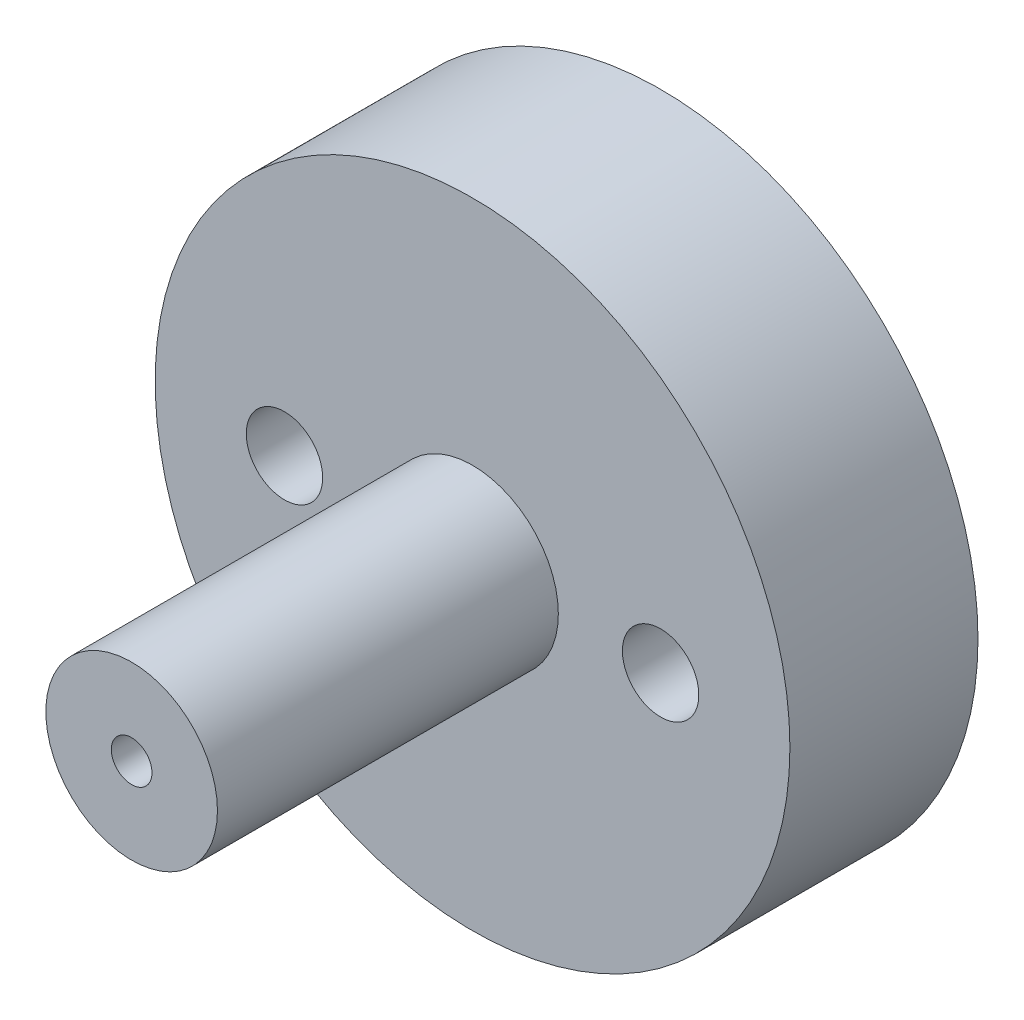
ISO-10303-21;
HEADER;
FILE_DESCRIPTION(('STEP AP214'),'2;1');
FILE_NAME('part.step','',(''),(''),'','','');
FILE_SCHEMA(('AUTOMOTIVE_DESIGN { 1 0 10303 214 1 1 1 1 }'));
ENDSEC;
DATA;
#1=APPLICATION_CONTEXT('core data for automotive mechanical design processes');
#2=APPLICATION_PROTOCOL_DEFINITION('international standard','automotive_design',2000,#1);
#3=PRODUCT_CONTEXT('',#1,'mechanical');
#4=PRODUCT('Part','Part','',(#3));
#5=PRODUCT_RELATED_PRODUCT_CATEGORY('part','',(#4));
#6=PRODUCT_DEFINITION_FORMATION('','',#4);
#7=PRODUCT_DEFINITION_CONTEXT('part definition',#1,'design');
#8=PRODUCT_DEFINITION('design','',#6,#7);
#9=PRODUCT_DEFINITION_SHAPE('','',#8);
#10=(LENGTH_UNIT() NAMED_UNIT(*) SI_UNIT(.MILLI.,.METRE.));
#11=(NAMED_UNIT(*) PLANE_ANGLE_UNIT() SI_UNIT($,.RADIAN.));
#12=(NAMED_UNIT(*) SI_UNIT($,.STERADIAN.) SOLID_ANGLE_UNIT());
#13=UNCERTAINTY_MEASURE_WITH_UNIT(LENGTH_MEASURE(1.E-05),#10,'distance_accuracy_value','');
#14=(GEOMETRIC_REPRESENTATION_CONTEXT(3) GLOBAL_UNCERTAINTY_ASSIGNED_CONTEXT((#13)) GLOBAL_UNIT_ASSIGNED_CONTEXT((#10,
#11,#12)) REPRESENTATION_CONTEXT('',''));
#15=CARTESIAN_POINT('',(0.,0.,0.));
#16=DIRECTION('',(0.,0.,1.));
#17=DIRECTION('',(1.,0.,0.));
#18=AXIS2_PLACEMENT_3D('',#15,#16,#17);
#19=CARTESIAN_POINT('',(0.,0.,12.));
#20=DIRECTION('',(0.,0.,1.));
#21=DIRECTION('',(-1.,0.,0.));
#22=AXIS2_PLACEMENT_3D('',#19,#20,#21);
#23=CYLINDRICAL_SURFACE('',#22,0.865);
#24=CARTESIAN_POINT('',(0.,0.,32.));
#25=DIRECTION('',(0.,0.,-1.));
#26=DIRECTION('',(-1.,0.,0.));
#27=AXIS2_PLACEMENT_3D('',#24,#25,#26);
#28=CIRCLE('',#27,0.865);
#29=CARTESIAN_POINT('',(0.865,0.,32.));
#30=VERTEX_POINT('',#29);
#31=EDGE_CURVE('E368',#30,#30,#28,.T.);
#32=ORIENTED_EDGE('',*,*,#31,.F.);
#33=DIRECTION('',(0.,0.,-1.));
#34=VECTOR('',#33,1.);
#35=CARTESIAN_POINT('',(0.865,0.,12.));
#36=LINE('',#35,#34);
#37=CARTESIAN_POINT('',(0.865,0.,20.));
#38=VERTEX_POINT('',#37);
#39=EDGE_CURVE('E11',#30,#38,#36,.T.);
#40=ORIENTED_EDGE('',*,*,#39,.T.);
#41=CARTESIAN_POINT('',(0.,0.,20.));
#42=DIRECTION('',(0.,0.,-1.));
#43=DIRECTION('',(-1.,0.,0.));
#44=AXIS2_PLACEMENT_3D('',#41,#42,#43);
#45=CIRCLE('',#44,0.865);
#46=EDGE_CURVE('E302',#38,#38,#45,.T.);
#47=ORIENTED_EDGE('',*,*,#46,.T.);
#48=ORIENTED_EDGE('',*,*,#39,.F.);
#49=EDGE_LOOP('',(#32,#40,#47,#48));
#50=FACE_BOUND('',#49,.T.);
#51=ADVANCED_FACE('F51',(#50),#23,.F.);
#52=CARTESIAN_POINT('',(0.,0.,32.));
#53=DIRECTION('',(0.,0.,-1.));
#54=DIRECTION('',(-1.,0.,0.));
#55=AXIS2_PLACEMENT_3D('',#52,#53,#54);
#56=CYLINDRICAL_SURFACE('',#55,3.65);
#57=CARTESIAN_POINT('',(-1.175,-3.45570181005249,19.407216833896));
#58=CARTESIAN_POINT('',(-1.17499976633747,-3.45570186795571,19.3346445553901));
#59=CARTESIAN_POINT('',(-1.17251493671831,-3.45654997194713,19.2620684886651));
#60=CARTESIAN_POINT('',(-1.16203956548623,-3.46008615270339,19.117320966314));
#61=CARTESIAN_POINT('',(-1.15404749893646,-3.46277473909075,19.0451496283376));
#62=CARTESIAN_POINT('',(-1.13190031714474,-3.47007767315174,18.902100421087));
#63=CARTESIAN_POINT('',(-1.117767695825,-3.47468498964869,18.8312188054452));
#64=CARTESIAN_POINT('',(-1.08252275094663,-3.4858266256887,18.6914087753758));
#65=CARTESIAN_POINT('',(-1.0614175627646,-3.49235897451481,18.622478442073));
#66=CARTESIAN_POINT('',(-1.00988058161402,-3.50762150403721,18.4839180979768));
#67=CARTESIAN_POINT('',(-0.978992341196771,-3.51645435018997,18.4144654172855));
#68=CARTESIAN_POINT('',(-0.907344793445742,-3.53561855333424,18.2810589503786));
#69=CARTESIAN_POINT('',(-0.866597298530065,-3.54594811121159,18.2170987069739));
#70=CARTESIAN_POINT('',(-0.781646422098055,-3.56554597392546,18.1064793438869));
#71=CARTESIAN_POINT('',(-0.738932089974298,-3.57473399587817,18.058671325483));
#72=CARTESIAN_POINT('',(-0.646045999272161,-3.59268085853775,17.9707609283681));
#73=CARTESIAN_POINT('',(-0.595875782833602,-3.60143978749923,17.9306569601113));
#74=CARTESIAN_POINT('',(-0.488423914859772,-3.61758329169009,17.8598568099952));
#75=CARTESIAN_POINT('',(-0.431087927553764,-3.62495615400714,17.8292395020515));
#76=CARTESIAN_POINT('',(-0.31130946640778,-3.63719546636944,17.7796946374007));
#77=CARTESIAN_POINT('',(-0.248871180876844,-3.64206394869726,17.7607575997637));
#78=CARTESIAN_POINT('',(-0.130390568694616,-3.6480828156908,17.7375421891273));
#79=CARTESIAN_POINT('',(-0.0746986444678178,-3.64966292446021,17.7315644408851));
#80=CARTESIAN_POINT('',(0.0368802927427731,-3.6502391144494,17.7293729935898));
#81=CARTESIAN_POINT('',(0.0927672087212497,-3.64923633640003,17.7331549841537));
#82=CARTESIAN_POINT('',(0.199577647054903,-3.64490822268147,17.749762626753));
#83=CARTESIAN_POINT('',(0.250596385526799,-3.64172775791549,17.7620246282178));
#84=CARTESIAN_POINT('',(0.349883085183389,-3.63353336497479,17.7944507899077));
#85=CARTESIAN_POINT('',(0.398151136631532,-3.62851949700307,17.8146146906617));
#86=CARTESIAN_POINT('',(0.492467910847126,-3.61694808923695,17.8628515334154));
#87=CARTESIAN_POINT('',(0.538383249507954,-3.61034339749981,17.8911725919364));
#88=CARTESIAN_POINT('',(0.625352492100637,-3.59630069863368,17.9542955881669));
#89=CARTESIAN_POINT('',(0.666404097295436,-3.5888623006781,17.9891005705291));
#90=CARTESIAN_POINT('',(0.75739518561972,-3.57095670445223,18.0778320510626));
#91=CARTESIAN_POINT('',(0.805051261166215,-3.56038164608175,18.1340834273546));
#92=CARTESIAN_POINT('',(0.890512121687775,-3.53997502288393,18.2537388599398));
#93=CARTESIAN_POINT('',(0.928298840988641,-3.53014484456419,18.3171557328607));
#94=CARTESIAN_POINT('',(1.00769995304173,-3.50847066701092,18.474583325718));
#95=CARTESIAN_POINT('',(1.04501554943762,-3.49734620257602,18.5708472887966));
#96=CARTESIAN_POINT('',(1.104555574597,-3.47899552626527,18.7682369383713));
#97=CARTESIAN_POINT('',(1.12675313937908,-3.47177625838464,18.8693709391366));
#98=CARTESIAN_POINT('',(1.15478942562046,-3.46252903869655,19.0495565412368));
#99=CARTESIAN_POINT('',(1.16325280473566,-3.45967793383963,19.1281855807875));
#100=CARTESIAN_POINT('',(1.17371038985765,-3.45614472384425,19.2859526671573));
#101=CARTESIAN_POINT('',(1.17570097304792,-3.45546383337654,19.3650909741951));
#102=CARTESIAN_POINT('',(1.17386769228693,-3.45608643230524,19.5234927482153));
#103=CARTESIAN_POINT('',(1.17002778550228,-3.45739539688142,19.6027559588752));
#104=CARTESIAN_POINT('',(1.15695723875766,-3.46179102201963,19.7607613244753));
#105=CARTESIAN_POINT('',(1.14772775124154,-3.4648773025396,19.8395035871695));
#106=CARTESIAN_POINT('',(1.12353614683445,-3.47279959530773,20.0000554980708));
#107=CARTESIAN_POINT('',(1.1083102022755,-3.47771545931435,20.081821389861));
#108=CARTESIAN_POINT('',(1.07223135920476,-3.48900819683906,20.2440339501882));
#109=CARTESIAN_POINT('',(1.05137640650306,-3.49538560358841,20.324480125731));
#110=CARTESIAN_POINT('',(1.00392323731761,-3.5093087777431,20.4832095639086));
#111=CARTESIAN_POINT('',(0.977348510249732,-3.51684973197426,20.5615002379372));
#112=CARTESIAN_POINT('',(0.917907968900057,-3.53283131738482,20.7155208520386));
#113=CARTESIAN_POINT('',(0.885047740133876,-3.54127114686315,20.7912529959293));
#114=CARTESIAN_POINT('',(0.821238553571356,-3.55652270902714,20.9205616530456));
#115=CARTESIAN_POINT('',(0.791875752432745,-3.56321215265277,20.9749327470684));
#116=CARTESIAN_POINT('',(0.728437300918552,-3.57672119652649,21.08095549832));
#117=CARTESIAN_POINT('',(0.694356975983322,-3.58354092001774,21.1326043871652));
#118=CARTESIAN_POINT('',(0.620393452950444,-3.59708798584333,21.2323047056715));
#119=CARTESIAN_POINT('',(0.580465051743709,-3.60381411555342,21.2803232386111));
#120=CARTESIAN_POINT('',(0.493983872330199,-3.61668167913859,21.3701117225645));
#121=CARTESIAN_POINT('',(0.44744790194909,-3.62282453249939,21.4118969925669));
#122=CARTESIAN_POINT('',(0.366818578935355,-3.63164850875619,21.4709590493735));
#123=CARTESIAN_POINT('',(0.335096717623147,-3.63473711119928,21.4913881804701));
#124=CARTESIAN_POINT('',(0.268946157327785,-3.64022901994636,21.5274439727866));
#125=CARTESIAN_POINT('',(0.234519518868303,-3.64263284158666,21.543074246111));
#126=CARTESIAN_POINT('',(0.162964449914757,-3.64653765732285,21.568351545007));
#127=CARTESIAN_POINT('',(0.125808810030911,-3.64802760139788,21.5779253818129));
#128=CARTESIAN_POINT('',(0.0503198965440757,-3.64984734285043,21.5896072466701));
#129=CARTESIAN_POINT('',(0.0119882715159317,-3.65017869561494,21.5917252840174));
#130=CARTESIAN_POINT('',(-0.0591979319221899,-3.64967030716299,21.5884669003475));
#131=CARTESIAN_POINT('',(-0.092102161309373,-3.64898063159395,21.5840508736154));
#132=CARTESIAN_POINT('',(-0.156709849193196,-3.64677790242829,21.5698829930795));
#133=CARTESIAN_POINT('',(-0.188412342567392,-3.64526420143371,21.5601269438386));
#134=CARTESIAN_POINT('',(-0.260019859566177,-3.64095637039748,21.5321776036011));
#135=CARTESIAN_POINT('',(-0.299234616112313,-3.63790580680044,21.5122714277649));
#136=CARTESIAN_POINT('',(-0.373965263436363,-3.63098695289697,21.4665624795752));
#137=CARTESIAN_POINT('',(-0.409472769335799,-3.62711686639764,21.4407467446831));
#138=CARTESIAN_POINT('',(-0.498301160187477,-3.61625407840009,21.3671764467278));
#139=CARTESIAN_POINT('',(-0.548621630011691,-3.60883866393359,21.315898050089));
#140=CARTESIAN_POINT('',(-0.641236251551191,-3.5935385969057,21.206644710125));
#141=CARTESIAN_POINT('',(-0.683506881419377,-3.58565265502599,21.148650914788));
#142=CARTESIAN_POINT('',(-0.759305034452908,-3.57034477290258,21.0316153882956));
#143=CARTESIAN_POINT('',(-0.793178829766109,-3.56292053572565,20.972794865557));
#144=CARTESIAN_POINT('',(-0.855858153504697,-3.54838574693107,20.8524447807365));
#145=CARTESIAN_POINT('',(-0.884659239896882,-3.54127547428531,20.7909129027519));
#146=CARTESIAN_POINT('',(-0.937798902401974,-3.52757494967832,20.6658317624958));
#147=CARTESIAN_POINT('',(-0.96213262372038,-3.52098526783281,20.6022803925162));
#148=CARTESIAN_POINT('',(-1.00669557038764,-3.50850372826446,20.4736841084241));
#149=CARTESIAN_POINT('',(-1.0269240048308,-3.50261200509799,20.408638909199));
#150=CARTESIAN_POINT('',(-1.06636321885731,-3.49082475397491,20.26713349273));
#151=CARTESIAN_POINT('',(-1.08492016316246,-3.48507271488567,20.1904788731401));
#152=CARTESIAN_POINT('',(-1.11698145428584,-3.47492938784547,20.0360178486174));
#153=CARTESIAN_POINT('',(-1.13048474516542,-3.47053838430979,19.9582112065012));
#154=CARTESIAN_POINT('',(-1.15236107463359,-3.46333607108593,19.8017556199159));
#155=CARTESIAN_POINT('',(-1.16073103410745,-3.4605257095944,19.723106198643));
#156=CARTESIAN_POINT('',(-1.17205011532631,-3.45670871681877,19.5653782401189));
#157=CARTESIAN_POINT('',(-1.17500025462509,-3.45570174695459,19.486299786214));
#158=CARTESIAN_POINT('',(-1.175,-3.45570181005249,19.407216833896));
#159=B_SPLINE_CURVE_WITH_KNOTS('',3,(#57,#58,#59,#60,#61,#62,#63,#64,#65,#66,#67,#68,#69,#70,
#71,#72,#73,#74,#75,#76,#77,#78,#79,#80,#81,#82,#83,#84,#85,#86,#87,#88,#89,#90,#91,#92,#93,#94,
#95,#96,#97,#98,#99,#100,#101,#102,#103,#104,#105,#106,#107,#108,#109,#110,#111,#112,#113,#114,
#115,#116,#117,#118,#119,#120,#121,#122,#123,#124,#125,#126,#127,#128,#129,#130,#131,#132,#133,
#134,#135,#136,#137,#138,#139,#140,#141,#142,#143,#144,#145,#146,#147,#148,#149,#150,#151,#152,
#153,#154,#155,#156,#157,#158),.UNSPECIFIED.,.T.,.F.,(4,2,2,2,2,2,2,2,2,2,2,2,2,2,2,2,2,2,2,2,2,
2,2,2,2,2,2,2,2,2,2,2,2,2,2,2,2,2,2,2,2,2,2,2,2,2,2,2,2,2,4),(0.,0.217664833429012,
0.435389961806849,0.652324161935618,0.86903704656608,1.09789654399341,1.32648318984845,
1.5200037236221,1.71348428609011,1.90853280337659,2.10342278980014,2.27064488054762,
2.43779313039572,2.59478201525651,2.75176574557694,2.91414746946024,3.07660563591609,
3.29880857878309,3.52141545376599,3.83122194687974,4.14157752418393,4.37867408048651,
4.61590331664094,4.8537864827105,5.09161880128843,5.34135608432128,5.5911846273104,
5.84000613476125,6.08860754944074,6.2748840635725,6.46134649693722,6.64933476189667,
6.83685312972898,6.9501051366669,7.0632716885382,7.17778091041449,7.29213634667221,
7.39126440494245,7.49047045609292,7.62197847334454,7.75377776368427,7.96924252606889,
8.18532753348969,8.38987730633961,8.5946053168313,8.79955451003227,9.00454315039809,
9.24158830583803,9.47868296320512,9.71591969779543,9.95311188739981),.UNSPECIFIED.);
#160=CARTESIAN_POINT('',(1.175,-3.45570181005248,19.407216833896));
#161=VERTEX_POINT('',#160);
#162=EDGE_CURVE('E55',#161,#161,#159,.F.);
#163=ORIENTED_EDGE('',*,*,#162,.T.);
#164=EDGE_LOOP('',(#163));
#165=FACE_BOUND('',#164,.T.);
#166=CARTESIAN_POINT('',(0.,0.,17.5));
#167=DIRECTION('',(0.,0.,1.));
#168=DIRECTION('',(-1.,0.,0.));
#169=AXIS2_PLACEMENT_3D('',#166,#167,#168);
#170=CIRCLE('',#169,3.65);
#171=CARTESIAN_POINT('',(3.65,0.,17.5));
#172=VERTEX_POINT('',#171);
#173=EDGE_CURVE('E343',#172,#172,#170,.T.);
#174=ORIENTED_EDGE('',*,*,#173,.T.);
#175=DIRECTION('',(0.,0.,1.));
#176=VECTOR('',#175,1.);
#177=CARTESIAN_POINT('',(3.65,0.,32.));
#178=LINE('',#177,#176);
#179=CARTESIAN_POINT('',(3.65,0.,32.));
#180=VERTEX_POINT('',#179);
#181=EDGE_CURVE('E66',#172,#180,#178,.T.);
#182=ORIENTED_EDGE('',*,*,#181,.T.);
#183=CARTESIAN_POINT('',(0.,0.,32.));
#184=DIRECTION('',(0.,0.,-1.));
#185=DIRECTION('',(-1.,0.,0.));
#186=AXIS2_PLACEMENT_3D('',#183,#184,#185);
#187=CIRCLE('',#186,3.65);
#188=EDGE_CURVE('E346',#180,#180,#187,.T.);
#189=ORIENTED_EDGE('',*,*,#188,.T.);
#190=ORIENTED_EDGE('',*,*,#181,.F.);
#191=EDGE_LOOP('',(#174,#182,#189,#190));
#192=FACE_BOUND('',#191,.T.);
#193=ADVANCED_FACE('F443',(#165,#192),#56,.T.);
#194=CARTESIAN_POINT('',(0.,0.,32.));
#195=DIRECTION('',(0.,0.,1.));
#196=DIRECTION('',(1.,0.,0.));
#197=AXIS2_PLACEMENT_3D('',#194,#195,#196);
#198=PLANE('',#197);
#199=ORIENTED_EDGE('',*,*,#31,.T.);
#200=EDGE_LOOP('',(#199));
#201=FACE_BOUND('',#200,.T.);
#202=ORIENTED_EDGE('',*,*,#188,.F.);
#203=EDGE_LOOP('',(#202));
#204=FACE_BOUND('',#203,.T.);
#205=ADVANCED_FACE('F53',(#201,#204),#198,.T.);
#206=CARTESIAN_POINT('',(-0.69180806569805,-1.19445578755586,17.5));
#207=DIRECTION('',(0.,0.,1.));
#208=DIRECTION('',(1.,0.,0.));
#209=AXIS2_PLACEMENT_3D('',#206,#207,#208);
#210=PLANE('',#209);
#211=ORIENTED_EDGE('',*,*,#173,.F.);
#212=EDGE_LOOP('',(#211));
#213=FACE_BOUND('',#212,.T.);
#214=CARTESIAN_POINT('',(8.,0.,17.5));
#215=DIRECTION('',(0.,0.,-1.));
#216=DIRECTION('',(1.,0.,0.));
#217=AXIS2_PLACEMENT_3D('',#214,#215,#216);
#218=CIRCLE('',#217,1.625);
#219=CARTESIAN_POINT('',(6.375,0.,17.5));
#220=VERTEX_POINT('',#219);
#221=EDGE_CURVE('E329',#220,#220,#218,.T.);
#222=ORIENTED_EDGE('',*,*,#221,.T.);
#223=EDGE_LOOP('',(#222));
#224=FACE_BOUND('',#223,.T.);
#225=CARTESIAN_POINT('',(-8.,0.,17.5));
#226=DIRECTION('',(0.,0.,-1.));
#227=DIRECTION('',(1.,0.,0.));
#228=AXIS2_PLACEMENT_3D('',#225,#226,#227);
#229=CIRCLE('',#228,1.625);
#230=CARTESIAN_POINT('',(-9.625,0.,17.5));
#231=VERTEX_POINT('',#230);
#232=EDGE_CURVE('E316',#231,#231,#229,.T.);
#233=ORIENTED_EDGE('',*,*,#232,.T.);
#234=EDGE_LOOP('',(#233));
#235=FACE_BOUND('',#234,.T.);
#236=CARTESIAN_POINT('',(0.,0.,17.5));
#237=DIRECTION('',(0.,0.,1.));
#238=DIRECTION('',(-1.,0.,0.));
#239=AXIS2_PLACEMENT_3D('',#236,#237,#238);
#240=CIRCLE('',#239,13.5);
#241=CARTESIAN_POINT('',(13.5,0.,17.5));
#242=VERTEX_POINT('',#241);
#243=EDGE_CURVE('E347',#242,#242,#240,.T.);
#244=ORIENTED_EDGE('',*,*,#243,.T.);
#245=EDGE_LOOP('',(#244));
#246=FACE_BOUND('',#245,.T.);
#247=ADVANCED_FACE('F447',(#213,#224,#235,#246),#210,.T.);
#248=CARTESIAN_POINT('',(0.,0.,12.));
#249=DIRECTION('',(0.,0.,-1.));
#250=DIRECTION('',(-1.,0.,0.));
#251=AXIS2_PLACEMENT_3D('',#248,#249,#250);
#252=CYLINDRICAL_SURFACE('',#251,13.5);
#253=CARTESIAN_POINT('',(0.,0.,9.5));
#254=DIRECTION('',(0.,0.,-1.));
#255=DIRECTION('',(1.,0.,0.));
#256=AXIS2_PLACEMENT_3D('',#253,#254,#255);
#257=CIRCLE('',#256,13.5);
#258=CARTESIAN_POINT('',(13.5,0.,9.5));
#259=VERTEX_POINT('',#258);
#260=EDGE_CURVE('E303',#259,#259,#257,.T.);
#261=ORIENTED_EDGE('',*,*,#260,.F.);
#262=DIRECTION('',(0.,0.,1.));
#263=VECTOR('',#262,1.);
#264=CARTESIAN_POINT('',(13.5,0.,12.));
#265=LINE('',#264,#263);
#266=EDGE_CURVE('E360',#259,#242,#265,.T.);
#267=ORIENTED_EDGE('',*,*,#266,.T.);
#268=ORIENTED_EDGE('',*,*,#243,.F.);
#269=ORIENTED_EDGE('',*,*,#266,.F.);
#270=EDGE_LOOP('',(#261,#267,#268,#269));
#271=FACE_BOUND('',#270,.T.);
#272=ADVANCED_FACE('F450',(#271),#252,.T.);
#273=CARTESIAN_POINT('',(0.,0.,15.));
#274=DIRECTION('',(0.,0.,1.));
#275=DIRECTION('',(1.,0.,0.));
#276=AXIS2_PLACEMENT_3D('',#273,#274,#275);
#277=PLANE('',#276);
#278=DIRECTION('',(-1.,0.,0.));
#279=VECTOR('',#278,1.);
#280=CARTESIAN_POINT('',(0.,0.125554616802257,15.));
#281=LINE('',#280,#279);
#282=CARTESIAN_POINT('',(1.1642935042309,0.125554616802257,15.));
#283=VERTEX_POINT('',#282);
#284=CARTESIAN_POINT('',(1.12209752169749,0.125554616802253,15.));
#285=VERTEX_POINT('',#284);
#286=EDGE_CURVE('E176',#283,#285,#281,.T.);
#287=ORIENTED_EDGE('',*,*,#286,.T.);
#288=CARTESIAN_POINT('',(0.,0.,15.));
#289=DIRECTION('',(0.,0.,1.));
#290=DIRECTION('',(1.,0.,0.));
#291=AXIS2_PLACEMENT_3D('',#288,#289,#290);
#292=CIRCLE('',#291,1.1291);
#293=CARTESIAN_POINT('',(-1.12209752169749,0.125554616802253,15.));
#294=VERTEX_POINT('',#293);
#295=EDGE_CURVE('E286',#285,#294,#292,.T.);
#296=ORIENTED_EDGE('',*,*,#295,.T.);
#297=DIRECTION('',(-1.,0.,0.));
#298=VECTOR('',#297,1.);
#299=CARTESIAN_POINT('',(0.,0.125554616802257,15.));
#300=LINE('',#299,#298);
#301=CARTESIAN_POINT('',(-1.1642935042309,0.125554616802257,15.));
#302=VERTEX_POINT('',#301);
#303=EDGE_CURVE('E278',#294,#302,#300,.T.);
#304=ORIENTED_EDGE('',*,*,#303,.T.);
#305=CARTESIAN_POINT('',(0.,-0.0739253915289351,15.));
#306=DIRECTION('',(0.,0.,1.));
#307=DIRECTION('',(0.,1.,0.));
#308=AXIS2_PLACEMENT_3D('',#305,#306,#307);
#309=ELLIPSE('',#308,1.48105508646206,1.175);
#310=CARTESIAN_POINT('',(1.175,-0.0739253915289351,15.));
#311=VERTEX_POINT('',#310);
#312=EDGE_CURVE('E192',#302,#311,#309,.T.);
#313=ORIENTED_EDGE('',*,*,#312,.T.);
#314=CARTESIAN_POINT('',(0.,-0.0739253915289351,15.));
#315=DIRECTION('',(0.,0.,1.));
#316=DIRECTION('',(0.,1.,0.));
#317=AXIS2_PLACEMENT_3D('',#314,#315,#316);
#318=ELLIPSE('',#317,1.48105508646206,1.175);
#319=EDGE_CURVE('E188',#311,#283,#318,.T.);
#320=ORIENTED_EDGE('',*,*,#319,.T.);
#321=EDGE_LOOP('',(#287,#296,#304,#313,#320));
#322=FACE_BOUND('',#321,.T.);
#323=CARTESIAN_POINT('',(0.,0.,15.));
#324=DIRECTION('',(0.,0.,-1.));
#325=DIRECTION('',(1.,0.,0.));
#326=AXIS2_PLACEMENT_3D('',#323,#324,#325);
#327=CIRCLE('',#326,1.725);
#328=CARTESIAN_POINT('',(-1.725,0.,15.));
#329=VERTEX_POINT('',#328);
#330=EDGE_CURVE('E357',#329,#329,#327,.T.);
#331=ORIENTED_EDGE('',*,*,#330,.T.);
#332=EDGE_LOOP('',(#331));
#333=FACE_BOUND('',#332,.T.);
#334=ADVANCED_FACE('F189',(#322,#333),#277,.F.);
#335=CARTESIAN_POINT('',(0.,0.,12.));
#336=DIRECTION('',(0.,0.,1.));
#337=DIRECTION('',(1.,0.,0.));
#338=AXIS2_PLACEMENT_3D('',#335,#336,#337);
#339=CYLINDRICAL_SURFACE('',#338,1.725);
#340=CARTESIAN_POINT('',(0.,0.,12.));
#341=DIRECTION('',(0.,0.,-1.));
#342=DIRECTION('',(1.,0.,0.));
#343=AXIS2_PLACEMENT_3D('',#340,#341,#342);
#344=CIRCLE('',#343,1.725);
#345=CARTESIAN_POINT('',(-1.725,0.,12.));
#346=VERTEX_POINT('',#345);
#347=EDGE_CURVE('E298',#346,#346,#344,.T.);
#348=ORIENTED_EDGE('',*,*,#347,.T.);
#349=DIRECTION('',(0.,0.,1.));
#350=VECTOR('',#349,1.);
#351=CARTESIAN_POINT('',(-1.725,0.,12.));
#352=LINE('',#351,#350);
#353=EDGE_CURVE('E353',#346,#329,#352,.T.);
#354=ORIENTED_EDGE('',*,*,#353,.T.);
#355=ORIENTED_EDGE('',*,*,#330,.F.);
#356=ORIENTED_EDGE('',*,*,#353,.F.);
#357=EDGE_LOOP('',(#348,#354,#355,#356));
#358=FACE_BOUND('',#357,.T.);
#359=ADVANCED_FACE('F490',(#358),#339,.F.);
#360=CARTESIAN_POINT('',(0.,0.,20.));
#361=DIRECTION('',(0.,0.,1.));
#362=DIRECTION('',(1.,0.,0.));
#363=AXIS2_PLACEMENT_3D('',#360,#361,#362);
#364=PLANE('',#363);
#365=ORIENTED_EDGE('',*,*,#46,.F.);
#366=EDGE_LOOP('',(#365));
#367=FACE_BOUND('',#366,.T.);
#368=CARTESIAN_POINT('',(0.,0.,20.));
#369=DIRECTION('',(0.,0.,-1.));
#370=DIRECTION('',(1.,0.,0.));
#371=AXIS2_PLACEMENT_3D('',#368,#369,#370);
#372=CIRCLE('',#371,1.1291);
#373=CARTESIAN_POINT('',(-1.1291,0.,20.));
#374=VERTEX_POINT('',#373);
#375=EDGE_CURVE('E217',#374,#374,#372,.T.);
#376=ORIENTED_EDGE('',*,*,#375,.T.);
#377=EDGE_LOOP('',(#376));
#378=FACE_BOUND('',#377,.T.);
#379=ADVANCED_FACE('F471',(#367,#378),#364,.F.);
#380=CARTESIAN_POINT('',(0.,0.,12.));
#381=DIRECTION('',(0.,0.,1.));
#382=DIRECTION('',(1.,0.,0.));
#383=AXIS2_PLACEMENT_3D('',#380,#381,#382);
#384=PLANE('',#383);
#385=ORIENTED_EDGE('',*,*,#347,.F.);
#386=EDGE_LOOP('',(#385));
#387=FACE_BOUND('',#386,.T.);
#388=CARTESIAN_POINT('',(0.,0.,12.));
#389=DIRECTION('',(0.,0.,-1.));
#390=DIRECTION('',(1.,0.,0.));
#391=AXIS2_PLACEMENT_3D('',#388,#389,#390);
#392=CIRCLE('',#391,3.7);
#393=CARTESIAN_POINT('',(-3.7,0.,12.));
#394=VERTEX_POINT('',#393);
#395=EDGE_CURVE('E340',#394,#394,#392,.T.);
#396=ORIENTED_EDGE('',*,*,#395,.T.);
#397=EDGE_LOOP('',(#396));
#398=FACE_BOUND('',#397,.T.);
#399=ADVANCED_FACE('F462',(#387,#398),#384,.F.);
#400=CARTESIAN_POINT('',(0.,0.,9.5));
#401=DIRECTION('',(0.,0.,-1.));
#402=DIRECTION('',(0.,-1.,0.));
#403=AXIS2_PLACEMENT_3D('',#400,#401,#402);
#404=PLANE('',#403);
#405=CARTESIAN_POINT('',(0.,0.,9.5));
#406=DIRECTION('',(0.,0.,1.));
#407=DIRECTION('',(1.,0.,0.));
#408=AXIS2_PLACEMENT_3D('',#405,#406,#407);
#409=CIRCLE('',#408,3.7);
#410=CARTESIAN_POINT('',(-3.7,0.,9.5));
#411=VERTEX_POINT('',#410);
#412=EDGE_CURVE('E332',#411,#411,#409,.T.);
#413=ORIENTED_EDGE('',*,*,#412,.T.);
#414=EDGE_LOOP('',(#413));
#415=FACE_BOUND('',#414,.T.);
#416=CARTESIAN_POINT('',(8.,0.,9.5));
#417=DIRECTION('',(0.,0.,1.));
#418=DIRECTION('',(1.,0.,0.));
#419=AXIS2_PLACEMENT_3D('',#416,#417,#418);
#420=CIRCLE('',#419,1.625);
#421=CARTESIAN_POINT('',(6.375,0.,9.5));
#422=VERTEX_POINT('',#421);
#423=EDGE_CURVE('E311',#422,#422,#420,.T.);
#424=ORIENTED_EDGE('',*,*,#423,.T.);
#425=EDGE_LOOP('',(#424));
#426=FACE_BOUND('',#425,.T.);
#427=CARTESIAN_POINT('',(-8.,0.,9.5));
#428=DIRECTION('',(0.,0.,1.));
#429=DIRECTION('',(1.,0.,0.));
#430=AXIS2_PLACEMENT_3D('',#427,#428,#429);
#431=CIRCLE('',#430,1.625);
#432=CARTESIAN_POINT('',(-9.625,0.,9.5));
#433=VERTEX_POINT('',#432);
#434=EDGE_CURVE('E307',#433,#433,#431,.T.);
#435=ORIENTED_EDGE('',*,*,#434,.T.);
#436=EDGE_LOOP('',(#435));
#437=FACE_BOUND('',#436,.T.);
#438=ORIENTED_EDGE('',*,*,#260,.T.);
#439=EDGE_LOOP('',(#438));
#440=FACE_BOUND('',#439,.T.);
#441=ADVANCED_FACE('F459',(#415,#426,#437,#440),#404,.T.);
#442=CARTESIAN_POINT('',(0.,0.,12.));
#443=DIRECTION('',(0.,0.,-1.));
#444=DIRECTION('',(1.,0.,0.));
#445=AXIS2_PLACEMENT_3D('',#442,#443,#444);
#446=CYLINDRICAL_SURFACE('',#445,3.7);
#447=ORIENTED_EDGE('',*,*,#412,.F.);
#448=DIRECTION('',(0.,0.,1.));
#449=VECTOR('',#448,1.);
#450=CARTESIAN_POINT('',(-3.7,0.,12.));
#451=LINE('',#450,#449);
#452=EDGE_CURVE('E336',#411,#394,#451,.T.);
#453=ORIENTED_EDGE('',*,*,#452,.T.);
#454=ORIENTED_EDGE('',*,*,#395,.F.);
#455=ORIENTED_EDGE('',*,*,#452,.F.);
#456=EDGE_LOOP('',(#447,#453,#454,#455));
#457=FACE_BOUND('',#456,.T.);
#458=ADVANCED_FACE('F461',(#457),#446,.F.);
#459=CARTESIAN_POINT('',(8.,0.,4.5));
#460=DIRECTION('',(0.,0.,1.));
#461=DIRECTION('',(1.,0.,0.));
#462=AXIS2_PLACEMENT_3D('',#459,#460,#461);
#463=CYLINDRICAL_SURFACE('',#462,1.625);
#464=ORIENTED_EDGE('',*,*,#423,.F.);
#465=DIRECTION('',(0.,0.,1.));
#466=VECTOR('',#465,1.);
#467=CARTESIAN_POINT('',(6.375,0.,4.5));
#468=LINE('',#467,#466);
#469=EDGE_CURVE('E315',#422,#220,#468,.T.);
#470=ORIENTED_EDGE('',*,*,#469,.T.);
#471=ORIENTED_EDGE('',*,*,#221,.F.);
#472=ORIENTED_EDGE('',*,*,#469,.F.);
#473=EDGE_LOOP('',(#464,#470,#471,#472));
#474=FACE_BOUND('',#473,.T.);
#475=ADVANCED_FACE('F241',(#474),#463,.F.);
#476=CARTESIAN_POINT('',(-8.,0.,4.5));
#477=DIRECTION('',(0.,0.,1.));
#478=DIRECTION('',(1.,0.,0.));
#479=AXIS2_PLACEMENT_3D('',#476,#477,#478);
#480=CYLINDRICAL_SURFACE('',#479,1.625);
#481=ORIENTED_EDGE('',*,*,#434,.F.);
#482=DIRECTION('',(0.,0.,1.));
#483=VECTOR('',#482,1.);
#484=CARTESIAN_POINT('',(-9.625,0.,4.5));
#485=LINE('',#484,#483);
#486=EDGE_CURVE('E320',#433,#231,#485,.T.);
#487=ORIENTED_EDGE('',*,*,#486,.T.);
#488=ORIENTED_EDGE('',*,*,#232,.F.);
#489=ORIENTED_EDGE('',*,*,#486,.F.);
#490=EDGE_LOOP('',(#481,#487,#488,#489));
#491=FACE_BOUND('',#490,.T.);
#492=ADVANCED_FACE('F239',(#491),#480,.F.);
#493=CARTESIAN_POINT('',(0.,0.,15.));
#494=DIRECTION('',(0.,0.,1.));
#495=DIRECTION('',(1.,0.,0.));
#496=AXIS2_PLACEMENT_3D('',#493,#494,#495);
#497=CYLINDRICAL_SURFACE('',#496,1.1291);
#498=CARTESIAN_POINT('',(0.,0.,14.9036585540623));
#499=DIRECTION('',(0.,-0.608761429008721,0.793353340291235));
#500=DIRECTION('',(0.,0.793353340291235,0.608761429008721));
#501=AXIS2_PLACEMENT_3D('',#498,#499,#500);
#502=ELLIPSE('',#501,1.42319940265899,1.1291);
#503=CARTESIAN_POINT('',(1.04654072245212,0.423815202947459,15.2288633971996));
#504=VERTEX_POINT('',#503);
#505=EDGE_CURVE('E182',#285,#504,#502,.T.);
#506=ORIENTED_EDGE('',*,*,#505,.T.);
#507=CARTESIAN_POINT('',(1.04654072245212,0.423815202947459,15.2288633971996));
#508=CARTESIAN_POINT('',(1.05153144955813,0.411492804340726,15.2288649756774));
#509=CARTESIAN_POINT('',(1.05630366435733,0.399081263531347,15.2291466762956));
#510=CARTESIAN_POINT('',(1.06304494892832,0.380582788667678,15.2300488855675));
#511=CARTESIAN_POINT('',(1.06518693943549,0.374545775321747,15.2304187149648));
#512=CARTESIAN_POINT('',(1.06931578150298,0.362587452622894,15.2313106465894));
#513=CARTESIAN_POINT('',(1.07130508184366,0.356666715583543,15.231829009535));
#514=CARTESIAN_POINT('',(1.07513559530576,0.344945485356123,15.2330181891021));
#515=CARTESIAN_POINT('',(1.07697916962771,0.33914537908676,15.233685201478));
#516=CARTESIAN_POINT('',(1.08052524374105,0.327669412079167,15.2351717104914));
#517=CARTESIAN_POINT('',(1.08223001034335,0.321993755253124,15.2359873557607));
#518=CARTESIAN_POINT('',(1.08550538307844,0.310770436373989,15.2377711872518));
#519=CARTESIAN_POINT('',(1.08707815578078,0.305222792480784,15.2387354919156));
#520=CARTESIAN_POINT('',(1.09009632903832,0.294259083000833,15.2408166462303));
#521=CARTESIAN_POINT('',(1.09154379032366,0.288842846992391,15.2419296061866));
#522=CARTESIAN_POINT('',(1.09465637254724,0.276840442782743,15.244598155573));
#523=CARTESIAN_POINT('',(1.09629961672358,0.270258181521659,15.246197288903));
#524=CARTESIAN_POINT('',(1.09940959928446,0.257310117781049,15.2496354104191));
#525=CARTESIAN_POINT('',(1.1008798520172,0.250943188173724,15.251466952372));
#526=CARTESIAN_POINT('',(1.10365640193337,0.238431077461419,15.2553698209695));
#527=CARTESIAN_POINT('',(1.10496590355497,0.23228435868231,15.2574339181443));
#528=CARTESIAN_POINT('',(1.10743320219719,0.220216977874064,15.261801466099));
#529=CARTESIAN_POINT('',(1.10859387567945,0.214294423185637,15.2640980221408));
#530=CARTESIAN_POINT('',(1.11039514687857,0.20470407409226,15.2680889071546));
#531=CARTESIAN_POINT('',(1.11107036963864,0.201005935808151,15.2696952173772));
#532=CARTESIAN_POINT('',(1.11237842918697,0.193636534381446,15.2730313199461));
#533=CARTESIAN_POINT('',(1.11301105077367,0.189965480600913,15.2747616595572));
#534=CARTESIAN_POINT('',(1.11423488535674,0.182650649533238,15.2783455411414));
#535=CARTESIAN_POINT('',(1.11482584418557,0.179007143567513,15.2801997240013));
#536=CARTESIAN_POINT('',(1.11568050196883,0.173571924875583,15.2830684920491));
#537=CARTESIAN_POINT('',(1.1159607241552,0.171760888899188,15.2840417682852));
#538=CARTESIAN_POINT('',(1.11651114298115,0.168145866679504,15.2860191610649));
#539=CARTESIAN_POINT('',(1.11678130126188,0.166341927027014,15.2870233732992));
#540=CARTESIAN_POINT('',(1.1179357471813,0.158504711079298,15.2914619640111));
#541=CARTESIAN_POINT('',(1.11876407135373,0.152541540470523,15.2950362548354));
#542=CARTESIAN_POINT('',(1.12031598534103,0.140695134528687,15.3025245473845));
#543=CARTESIAN_POINT('',(1.12103786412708,0.134814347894,15.306442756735));
#544=CARTESIAN_POINT('',(1.1223814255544,0.123133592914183,15.3146187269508));
#545=CARTESIAN_POINT('',(1.12300123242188,0.117336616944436,15.3188810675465));
#546=CARTESIAN_POINT('',(1.12414499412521,0.105824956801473,15.3277448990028));
#547=CARTESIAN_POINT('',(1.12466695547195,0.100113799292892,15.3323512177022));
#548=CARTESIAN_POINT('',(1.12561931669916,0.0887749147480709,15.3419027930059));
#549=CARTESIAN_POINT('',(1.12604765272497,0.0831512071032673,15.3468530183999));
#550=CARTESIAN_POINT('',(1.12681695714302,0.0719884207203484,15.3570923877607));
#551=CARTESIAN_POINT('',(1.1271558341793,0.0664538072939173,15.3623865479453));
#552=CARTESIAN_POINT('',(1.12775034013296,0.0554699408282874,15.3733134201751));
#553=CARTESIAN_POINT('',(1.1280038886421,0.0500255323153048,15.3789511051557));
#554=CARTESIAN_POINT('',(1.12843173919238,0.0392241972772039,15.3905664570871));
#555=CARTESIAN_POINT('',(1.12860400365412,0.0338724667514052,15.3965490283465));
#556=CARTESIAN_POINT('',(1.12879816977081,0.0262167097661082,15.4054162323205));
#557=CARTESIAN_POINT('',(1.12885102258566,0.0238284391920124,15.408228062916));
#558=CARTESIAN_POINT('',(1.12894180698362,0.0190525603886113,15.4139338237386));
#559=CARTESIAN_POINT('',(1.12897947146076,0.0166656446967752,15.4168283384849));
#560=CARTESIAN_POINT('',(1.12907089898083,0.00944904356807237,15.4257115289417));
#561=CARTESIAN_POINT('',(1.12910000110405,0.00468762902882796,15.43175600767));
#562=CARTESIAN_POINT('',(1.12909999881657,-0.00502464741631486,15.4443963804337));
#563=CARTESIAN_POINT('',(1.12906655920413,-0.00996451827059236,15.4510006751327));
#564=CARTESIAN_POINT('',(1.12893648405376,-0.0198602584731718,15.4645255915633));
#565=CARTESIAN_POINT('',(1.12883784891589,-0.0248115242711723,15.4714495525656));
#566=CARTESIAN_POINT('',(1.12838757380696,-0.0419367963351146,15.4959220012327));
#567=CARTESIAN_POINT('',(1.12787876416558,-0.0537329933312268,15.5137331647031));
#568=CARTESIAN_POINT('',(1.12651011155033,-0.0774109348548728,15.5511439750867));
#569=CARTESIAN_POINT('',(1.12562719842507,-0.0892351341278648,15.570778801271));
#570=CARTESIAN_POINT('',(1.12350281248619,-0.112957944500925,15.6118438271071));
#571=CARTESIAN_POINT('',(1.12224054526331,-0.124803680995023,15.6333034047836));
#572=CARTESIAN_POINT('',(1.11935636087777,-0.148529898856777,15.6780332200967));
#573=CARTESIAN_POINT('',(1.11771607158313,-0.160360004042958,15.7013287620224));
#574=CARTESIAN_POINT('',(1.1140525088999,-0.184134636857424,15.7496909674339));
#575=CARTESIAN_POINT('',(1.11201153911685,-0.196038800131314,15.774776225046));
#576=CARTESIAN_POINT('',(1.10900061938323,-0.212149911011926,15.8104937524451));
#577=CARTESIAN_POINT('',(1.10810682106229,-0.216765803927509,15.8209483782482));
#578=CARTESIAN_POINT('',(1.10429105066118,-0.235857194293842,15.8647486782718));
#579=CARTESIAN_POINT('',(1.10119819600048,-0.249874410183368,15.8982776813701));
#580=CARTESIAN_POINT('',(1.0928669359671,-0.28453342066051,15.9820112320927));
#581=CARTESIAN_POINT('',(1.0873245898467,-0.305017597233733,16.0322496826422));
#582=CARTESIAN_POINT('',(1.07536423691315,-0.34478593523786,16.1311766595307));
#583=CARTESIAN_POINT('',(1.0689806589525,-0.364087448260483,16.1798623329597));
#584=CARTESIAN_POINT('',(1.05927009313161,-0.391002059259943,16.2485135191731));
#585=CARTESIAN_POINT('',(1.05636269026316,-0.398790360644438,16.2684709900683));
#586=CARTESIAN_POINT('',(1.04359052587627,-0.431883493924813,16.353624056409));
#587=CARTESIAN_POINT('',(1.03289374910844,-0.4568767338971,16.4188193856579));
#588=CARTESIAN_POINT('',(1.01387717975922,-0.49721526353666,16.5257899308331));
#589=CARTESIAN_POINT('',(1.00608305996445,-0.512802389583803,16.5675687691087));
#590=CARTESIAN_POINT('',(0.994343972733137,-0.534982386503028,16.6277138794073));
#591=CARTESIAN_POINT('',(0.990689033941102,-0.541721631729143,16.6460830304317));
#592=CARTESIAN_POINT('',(0.976034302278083,-0.568089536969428,16.717906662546));
#593=CARTESIAN_POINT('',(0.964363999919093,-0.587703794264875,16.7712313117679));
#594=CARTESIAN_POINT('',(0.940382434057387,-0.625313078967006,16.8743177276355));
#595=CARTESIAN_POINT('',(0.928158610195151,-0.643331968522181,16.9240912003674));
#596=CARTESIAN_POINT('',(0.903204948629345,-0.677870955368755,17.0200333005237));
#597=CARTESIAN_POINT('',(0.890565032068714,-0.694410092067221,17.0662183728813));
#598=CARTESIAN_POINT('',(0.86495738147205,-0.726016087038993,17.1549910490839));
#599=CARTESIAN_POINT('',(0.852079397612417,-0.74110294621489,17.1975973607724));
#600=CARTESIAN_POINT('',(0.82614439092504,-0.769868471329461,17.2792064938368));
#601=CARTESIAN_POINT('',(0.813179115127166,-0.783565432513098,17.3182319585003));
#602=CARTESIAN_POINT('',(0.78720692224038,-0.80961826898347,17.3926775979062));
#603=CARTESIAN_POINT('',(0.774295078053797,-0.821990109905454,17.4281251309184));
#604=CARTESIAN_POINT('',(0.754523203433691,-0.840019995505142,17.4797918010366));
#605=CARTESIAN_POINT('',(0.748115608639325,-0.845733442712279,17.4961654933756));
#606=CARTESIAN_POINT('',(0.730406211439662,-0.861157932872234,17.5403312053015));
#607=CARTESIAN_POINT('',(0.718841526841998,-0.870844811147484,17.5680271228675));
#608=CARTESIAN_POINT('',(0.695353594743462,-0.889700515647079,17.6218735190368));
#609=CARTESIAN_POINT('',(0.683467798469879,-0.898873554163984,17.6480388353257));
#610=CARTESIAN_POINT('',(0.659359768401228,-0.9166929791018,17.6988227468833));
#611=CARTESIAN_POINT('',(0.647176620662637,-0.925344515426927,17.723458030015));
#612=CARTESIAN_POINT('',(0.622496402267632,-0.942113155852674,17.771179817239));
#613=CARTESIAN_POINT('',(0.610040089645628,-0.950236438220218,17.7942851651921));
#614=CARTESIAN_POINT('',(0.584835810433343,-0.965941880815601,17.8389448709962));
#615=CARTESIAN_POINT('',(0.572130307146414,-0.973531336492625,17.8605205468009));
#616=CARTESIAN_POINT('',(0.546449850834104,-0.988163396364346,17.9021182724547));
#617=CARTESIAN_POINT('',(0.533519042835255,-0.995214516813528,17.9221644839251));
#618=CARTESIAN_POINT('',(0.50740991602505,-1.00876520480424,17.9607004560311));
#619=CARTESIAN_POINT('',(0.494277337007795,-1.01527461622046,17.979217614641));
#620=CARTESIAN_POINT('',(0.467786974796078,-1.02773789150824,18.0146915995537));
#621=CARTESIAN_POINT('',(0.454476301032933,-1.03370305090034,18.031679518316));
#622=CARTESIAN_POINT('',(0.427650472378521,-1.04507548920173,18.0640928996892));
#623=CARTESIAN_POINT('',(0.414183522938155,-1.05049558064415,18.0795534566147));
#624=CARTESIAN_POINT('',(0.393570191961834,-1.05831011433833,18.1018671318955));
#625=CARTESIAN_POINT('',(0.38678051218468,-1.06081164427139,18.1090137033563));
#626=CARTESIAN_POINT('',(0.373164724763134,-1.06567619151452,18.1229190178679));
#627=CARTESIAN_POINT('',(0.366344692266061,-1.0680411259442,18.1296830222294));
#628=CARTESIAN_POINT('',(0.352671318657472,-1.07263242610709,18.1428227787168));
#629=CARTESIAN_POINT('',(0.345824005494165,-1.07486081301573,18.1492040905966));
#630=CARTESIAN_POINT('',(0.332098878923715,-1.07917907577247,18.1615782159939));
#631=CARTESIAN_POINT('',(0.325227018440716,-1.08127107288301,18.1675768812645));
#632=CARTESIAN_POINT('',(0.311455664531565,-1.08531666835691,18.1791853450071));
#633=CARTESIAN_POINT('',(0.304562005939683,-1.0872724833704,18.1848012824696));
#634=CARTESIAN_POINT('',(0.290750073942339,-1.09104586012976,18.1956442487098));
#635=CARTESIAN_POINT('',(0.283837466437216,-1.092865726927,18.2008776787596));
#636=CARTESIAN_POINT('',(0.269990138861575,-1.09636753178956,18.2109545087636));
#637=CARTESIAN_POINT('',(0.263060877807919,-1.09805184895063,18.2158045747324));
#638=CARTESIAN_POINT('',(0.24918473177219,-1.10128252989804,18.225117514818));
#639=CARTESIAN_POINT('',(0.242242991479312,-1.10283134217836,18.2295871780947));
#640=CARTESIAN_POINT('',(0.23053605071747,-1.10532470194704,18.2367786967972));
#641=CARTESIAN_POINT('',(0.225826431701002,-1.10629686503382,18.2395815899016));
#642=CARTESIAN_POINT('',(0.21638818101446,-1.10818128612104,18.245003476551));
#643=CARTESIAN_POINT('',(0.211660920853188,-1.10909422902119,18.2476246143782));
#644=CARTESIAN_POINT('',(0.202189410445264,-1.11085963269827,18.2526848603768));
#645=CARTESIAN_POINT('',(0.197446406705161,-1.1117127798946,18.2551260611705));
#646=CARTESIAN_POINT('',(0.187943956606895,-1.11335834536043,18.2598259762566));
#647=CARTESIAN_POINT('',(0.183185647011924,-1.11415144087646,18.262086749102));
#648=CARTESIAN_POINT('',(0.173653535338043,-1.11567658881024,18.2664259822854));
#649=CARTESIAN_POINT('',(0.168880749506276,-1.11640930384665,18.268506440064));
#650=CARTESIAN_POINT('',(0.159320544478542,-1.11781341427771,18.2724850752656));
#651=CARTESIAN_POINT('',(0.154534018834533,-1.11848545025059,18.2743851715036));
#652=CARTESIAN_POINT('',(0.144947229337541,-1.11976793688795,18.2780031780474));
#653=CARTESIAN_POINT('',(0.14014773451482,-1.12037899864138,18.2797229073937));
#654=CARTESIAN_POINT('',(0.130535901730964,-1.12153928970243,18.2829802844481));
#655=CARTESIAN_POINT('',(0.125724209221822,-1.12208909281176,18.2845196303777));
#656=CARTESIAN_POINT('',(0.11608888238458,-1.12312663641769,18.2874163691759));
#657=CARTESIAN_POINT('',(0.111265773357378,-1.12361490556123,18.2887753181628));
#658=CARTESIAN_POINT('',(0.101608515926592,-1.12452916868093,18.2913114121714));
#659=CARTESIAN_POINT('',(0.0967747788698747,-1.12495563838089,18.2924899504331));
#660=CARTESIAN_POINT('',(0.0870971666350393,-1.12574610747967,18.294665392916));
#661=CARTESIAN_POINT('',(0.0822535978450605,-1.12611052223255,18.2956635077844));
#662=CARTESIAN_POINT('',(0.0725572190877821,-1.12677670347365,18.2974782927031));
#663=CARTESIAN_POINT('',(0.0677046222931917,-1.12707881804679,18.2982959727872));
#664=CARTESIAN_POINT('',(0.0579910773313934,-1.12762023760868,18.2997500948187));
#665=CARTESIAN_POINT('',(0.0531302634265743,-1.1278598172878,18.3003873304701));
#666=CARTESIAN_POINT('',(0.0434011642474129,-1.1282760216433,18.3014807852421));
#667=CARTESIAN_POINT('',(0.038532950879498,-1.12845284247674,18.3019375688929));
#668=CARTESIAN_POINT('',(0.028789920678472,-1.1287433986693,18.3026703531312));
#669=CARTESIAN_POINT('',(0.0239151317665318,-1.12885724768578,18.3029466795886));
#670=CARTESIAN_POINT('',(0.0141598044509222,-1.12902174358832,18.3033187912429));
#671=CARTESIAN_POINT('',(0.00927926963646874,-1.12907241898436,18.3034146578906));
#672=CARTESIAN_POINT('',(-0.000486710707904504,-1.12911046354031,18.3034260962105));
#673=CARTESIAN_POINT('',(-0.00537215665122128,-1.1290977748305,18.3033415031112));
#674=CARTESIAN_POINT('',(-0.0151471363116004,-1.12900899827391,18.3029922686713));
#675=CARTESIAN_POINT('',(-0.0200366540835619,-1.1289327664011,18.3027272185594));
#676=CARTESIAN_POINT('',(-0.0298189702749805,-1.12871682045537,18.3020173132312));
#677=CARTESIAN_POINT('',(-0.034711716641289,-1.12857687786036,18.3015718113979));
#678=CARTESIAN_POINT('',(-0.0444996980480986,-1.12823343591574,18.3005012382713));
#679=CARTESIAN_POINT('',(-0.0493948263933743,-1.1280296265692,18.2998752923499));
#680=CARTESIAN_POINT('',(-0.0591867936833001,-1.12755838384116,18.2984440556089));
#681=CARTESIAN_POINT('',(-0.0640834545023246,-1.12729056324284,18.2976376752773));
#682=CARTESIAN_POINT('',(-0.0738777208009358,-1.12669123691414,18.29584578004));
#683=CARTESIAN_POINT('',(-0.0787750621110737,-1.12635927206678,18.2948589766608));
#684=CARTESIAN_POINT('',(-0.0885699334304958,-1.12563160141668,18.2927064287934));
#685=CARTESIAN_POINT('',(-0.0934671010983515,-1.12523537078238,18.2915392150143));
#686=CARTESIAN_POINT('',(-0.103260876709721,-1.12437911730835,18.2890260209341));
#687=CARTESIAN_POINT('',(-0.108157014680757,-1.12391851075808,18.2876784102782));
#688=CARTESIAN_POINT('',(-0.117947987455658,-1.12293345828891,18.2848045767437));
#689=CARTESIAN_POINT('',(-0.122842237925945,-1.12240837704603,18.2832765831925));
#690=CARTESIAN_POINT('',(-0.132628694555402,-1.12129433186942,18.2800421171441));
#691=CARTESIAN_POINT('',(-0.137520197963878,-1.12070468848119,18.2783337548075));
#692=CARTESIAN_POINT('',(-0.147300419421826,-1.11946147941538,18.2747386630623));
#693=CARTESIAN_POINT('',(-0.152188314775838,-1.11880719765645,18.272849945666));
#694=CARTESIAN_POINT('',(-0.161960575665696,-1.11743467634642,18.2688942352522));
#695=CARTESIAN_POINT('',(-0.166843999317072,-1.11671569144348,18.2668251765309));
#696=CARTESIAN_POINT('',(-0.176606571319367,-1.11521373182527,18.2625088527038));
#697=CARTESIAN_POINT('',(-0.181484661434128,-1.11442998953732,18.2602594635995));
#698=CARTESIAN_POINT('',(-0.191235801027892,-1.11279849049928,18.2555825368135));
#699=CARTESIAN_POINT('',(-0.196107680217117,-1.11194995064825,18.2531528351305));
#700=CARTESIAN_POINT('',(-0.205845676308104,-1.11018882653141,18.2481152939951));
#701=CARTESIAN_POINT('',(-0.21071051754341,-1.10927544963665,18.2455052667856));
#702=CARTESIAN_POINT('',(-0.220433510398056,-1.107384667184,18.2401071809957));
#703=CARTESIAN_POINT('',(-0.225290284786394,-1.10640646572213,18.2373169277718));
#704=CARTESIAN_POINT('',(-0.239972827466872,-1.10335011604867,18.2286059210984));
#705=CARTESIAN_POINT('',(-0.249659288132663,-1.10119588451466,18.2224755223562));
#706=CARTESIAN_POINT('',(-0.269001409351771,-1.09663450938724,18.2095114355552));
#707=CARTESIAN_POINT('',(-0.278644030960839,-1.09422113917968,18.2026606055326));
#708=CARTESIAN_POINT('',(-0.297893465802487,-1.08914137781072,18.188254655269));
#709=CARTESIAN_POINT('',(-0.30748628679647,-1.08646898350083,18.1806830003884));
#710=CARTESIAN_POINT('',(-0.326629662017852,-1.08087139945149,18.1648348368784));
#711=CARTESIAN_POINT('',(-0.336165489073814,-1.07794051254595,18.1565426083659));
#712=CARTESIAN_POINT('',(-0.355188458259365,-1.07182624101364,18.1392523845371));
#713=CARTESIAN_POINT('',(-0.364660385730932,-1.0686375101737,18.1302395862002));
#714=CARTESIAN_POINT('',(-0.383548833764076,-1.06200801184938,18.1115073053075));
#715=CARTESIAN_POINT('',(-0.392949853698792,-1.05856227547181,18.1017739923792));
#716=CARTESIAN_POINT('',(-0.411689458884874,-1.05141946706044,18.081599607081));
#717=CARTESIAN_POINT('',(-0.421012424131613,-1.04771781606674,18.0711456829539));
#718=CARTESIAN_POINT('',(-0.43958921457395,-1.04006382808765,18.0495294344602));
#719=CARTESIAN_POINT('',(-0.448827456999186,-1.03610729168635,18.0383552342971));
#720=CARTESIAN_POINT('',(-0.467226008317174,-1.02794537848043,18.0152961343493));
#721=CARTESIAN_POINT('',(-0.476370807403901,-1.02373620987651,18.003400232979));
#722=CARTESIAN_POINT('',(-0.49458130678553,-1.01506720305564,17.9789021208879));
#723=CARTESIAN_POINT('',(-0.503631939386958,-1.01060382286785,17.9662899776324));
#724=CARTESIAN_POINT('',(-0.522227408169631,-1.00113196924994,17.9394649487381));
#725=CARTESIAN_POINT('',(-0.531725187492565,-0.996115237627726,17.9252224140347));
#726=CARTESIAN_POINT('',(-0.561032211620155,-0.980118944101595,17.8796832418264));
#727=CARTESIAN_POINT('',(-0.579954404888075,-0.969006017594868,17.8478615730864));
#728=CARTESIAN_POINT('',(-0.617888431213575,-0.945320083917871,17.7799701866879));
#729=CARTESIAN_POINT('',(-0.636704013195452,-0.932715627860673,17.7438034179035));
#730=CARTESIAN_POINT('',(-0.674264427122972,-0.905988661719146,17.6671868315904));
#731=CARTESIAN_POINT('',(-0.692828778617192,-0.891836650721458,17.6266593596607));
#732=CARTESIAN_POINT('',(-0.729727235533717,-0.8619608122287,17.5413083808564));
#733=CARTESIAN_POINT('',(-0.747894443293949,-0.846209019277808,17.4964230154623));
#734=CARTESIAN_POINT('',(-0.783813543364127,-0.813110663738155,17.4023332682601));
#735=CARTESIAN_POINT('',(-0.801407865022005,-0.795739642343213,17.3530777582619));
#736=CARTESIAN_POINT('',(-0.836051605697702,-0.759315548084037,17.250273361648));
#737=CARTESIAN_POINT('',(-0.852955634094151,-0.740235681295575,17.1966850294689));
#738=CARTESIAN_POINT('',(-0.876859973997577,-0.71143704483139,17.1154824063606));
#739=CARTESIAN_POINT('',(-0.884634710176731,-0.701740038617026,17.0880859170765));
#740=CARTESIAN_POINT('',(-0.901392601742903,-0.680136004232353,17.0270166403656));
#741=CARTESIAN_POINT('',(-0.910255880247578,-0.668220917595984,16.993313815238));
#742=CARTESIAN_POINT('',(-0.928968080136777,-0.642019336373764,16.9196388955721));
#743=CARTESIAN_POINT('',(-0.938700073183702,-0.62769832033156,16.8796494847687));
#744=CARTESIAN_POINT('',(-0.958848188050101,-0.596550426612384,16.7933887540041));
#745=CARTESIAN_POINT('',(-0.969136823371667,-0.579678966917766,16.7471037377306));
#746=CARTESIAN_POINT('',(-0.990054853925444,-0.543282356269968,16.6482498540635));
#747=CARTESIAN_POINT('',(-1.00054486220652,-0.523704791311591,16.5956708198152));
#748=CARTESIAN_POINT('',(-1.02146285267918,-0.481759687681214,16.4842270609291));
#749=CARTESIAN_POINT('',(-1.03173675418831,-0.459336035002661,16.425354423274));
#750=CARTESIAN_POINT('',(-1.04636880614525,-0.424446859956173,16.3346607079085));
#751=CARTESIAN_POINT('',(-1.05127309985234,-0.412148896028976,16.3028621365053));
#752=CARTESIAN_POINT('',(-1.0609951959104,-0.386469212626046,16.2368860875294));
#753=CARTESIAN_POINT('',(-1.06577914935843,-0.37307518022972,16.2027084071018));
#754=CARTESIAN_POINT('',(-1.07761312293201,-0.337847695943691,16.1135826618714));
#755=CARTESIAN_POINT('',(-1.08427061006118,-0.315838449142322,16.0586512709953));
#756=CARTESIAN_POINT('',(-1.0943240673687,-0.278507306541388,15.9666766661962));
#757=CARTESIAN_POINT('',(-1.09807740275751,-0.263332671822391,15.9296123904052));
#758=CARTESIAN_POINT('',(-1.1030794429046,-0.241102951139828,15.876585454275));
#759=CARTESIAN_POINT('',(-1.10454479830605,-0.234306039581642,15.8605359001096));
#760=CARTESIAN_POINT('',(-1.10886797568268,-0.213266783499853,15.812240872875));
#761=CARTESIAN_POINT('',(-1.11161835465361,-0.198514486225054,15.7802067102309));
#762=CARTESIAN_POINT('',(-1.11646303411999,-0.169074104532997,15.7189691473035));
#763=CARTESIAN_POINT('',(-1.11859083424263,-0.154462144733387,15.6897317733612));
#764=CARTESIAN_POINT('',(-1.12189067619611,-0.127895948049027,15.6393074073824));
#765=CARTESIAN_POINT('',(-1.12316784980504,-0.116222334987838,15.6179804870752));
#766=CARTESIAN_POINT('',(-1.12533031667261,-0.0928801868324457,15.5771726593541));
#767=CARTESIAN_POINT('',(-1.12623605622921,-0.0812631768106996,15.5576634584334));
#768=CARTESIAN_POINT('',(-1.12766338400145,-0.0580392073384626,15.520493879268));
#769=CARTESIAN_POINT('',(-1.1282074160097,-0.0464884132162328,15.5027996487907));
#770=CARTESIAN_POINT('',(-1.12891124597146,-0.0233952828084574,15.4692805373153));
#771=CARTESIAN_POINT('',(-1.12909628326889,-0.0119143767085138,15.4534136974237));
#772=CARTESIAN_POINT('',(-1.1291,0.,15.4378659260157));
#773=B_SPLINE_CURVE_WITH_KNOTS('',3,(#507,#508,#509,#510,#511,#512,#513,#514,#515,#516,#517,
#518,#519,#520,#521,#522,#523,#524,#525,#526,#527,#528,#529,#530,#531,#532,#533,#534,#535,#536,
#537,#538,#539,#540,#541,#542,#543,#544,#545,#546,#547,#548,#549,#550,#551,#552,#553,#554,#555,
#556,#557,#558,#559,#560,#561,#562,#563,#564,#565,#566,#567,#568,#569,#570,#571,#572,#573,#574,
#575,#576,#577,#578,#579,#580,#581,#582,#583,#584,#585,#586,#587,#588,#589,#590,#591,#592,#593,
#594,#595,#596,#597,#598,#599,#600,#601,#602,#603,#604,#605,#606,#607,#608,#609,#610,#611,#612,
#613,#614,#615,#616,#617,#618,#619,#620,#621,#622,#623,#624,#625,#626,#627,#628,#629,#630,#631,
#632,#633,#634,#635,#636,#637,#638,#639,#640,#641,#642,#643,#644,#645,#646,#647,#648,#649,#650,
#651,#652,#653,#654,#655,#656,#657,#658,#659,#660,#661,#662,#663,#664,#665,#666,#667,#668,#669,
#670,#671,#672,#673,#674,#675,#676,#677,#678,#679,#680,#681,#682,#683,#684,#685,#686,#687,#688,
#689,#690,#691,#692,#693,#694,#695,#696,#697,#698,#699,#700,#701,#702,#703,#704,#705,#706,#707,
#708,#709,#710,#711,#712,#713,#714,#715,#716,#717,#718,#719,#720,#721,#722,#723,#724,#725,#726,
#727,#728,#729,#730,#731,#732,#733,#734,#735,#736,#737,#738,#739,#740,#741,#742,#743,#744,#745,
#746,#747,#748,#749,#750,#751,#752,#753,#754,#755,#756,#757,#758,#759,#760,#761,#762,#763,#764,
#765,#766,#767,#768,#769,#770,#771,#772),.UNSPECIFIED.,.F.,.F.,(4,2,2,2,2,2,2,2,2,2,2,2,2,2,2,2,
2,2,2,2,2,2,2,2,2,2,2,2,2,2,2,2,2,2,2,2,2,2,2,2,2,2,2,2,2,2,2,2,2,2,2,2,2,2,2,2,2,2,2,2,2,2,2,2,
2,2,2,2,2,2,2,2,2,2,2,2,2,2,2,2,2,2,2,2,2,2,2,2,2,2,2,2,2,2,2,2,2,2,2,2,2,2,2,2,2,2,2,2,2,2,2,2,
2,2,2,2,2,2,2,2,2,2,2,2,2,2,2,2,2,2,2,2,4),(0.,0.0398771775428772,0.0591239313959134,
0.0779233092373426,0.0962877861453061,0.114230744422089,0.131766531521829,0.148910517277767,
0.169814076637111,0.190165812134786,0.210003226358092,0.229366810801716,0.241629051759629,
0.253949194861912,0.266338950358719,0.272563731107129,0.278810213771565,0.299804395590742,
0.321105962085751,0.342763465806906,0.364823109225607,0.387328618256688,0.410321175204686,
0.433839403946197,0.457919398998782,0.46898781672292,0.480243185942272,0.503323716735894,
0.528063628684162,0.553599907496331,0.617678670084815,0.686471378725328,0.760085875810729,
0.838610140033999,0.922116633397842,0.956505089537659,1.06591276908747,1.22951066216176,
1.38777630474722,1.45263518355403,1.66451177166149,1.80030873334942,1.86002273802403,
2.03401185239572,2.19697881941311,2.34894019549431,2.48991642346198,2.6199331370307,
2.73902305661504,2.7944848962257,2.88908479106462,2.9795716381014,3.06599445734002,
3.14840952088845,3.22688172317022,3.3014862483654,3.37231059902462,3.43945705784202,
3.50304565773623,3.53355219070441,3.56322436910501,3.59208388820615,3.62015432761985,
3.64746131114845,3.67403267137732,3.6998986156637,3.7250918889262,3.74178789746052,
3.7582307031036,3.77443442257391,3.79041380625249,3.80618423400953,3.82176170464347,
3.83716281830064,3.85240475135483,3.86750522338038,3.88248245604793,3.89735512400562,
3.91214229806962,3.92686338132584,3.94153803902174,3.95618612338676,3.9708275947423,
3.98548244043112,4.00017059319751,4.01491185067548,4.02972579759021,4.04463173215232,
4.059648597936,4.07479492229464,4.09008876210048,4.10554765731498,4.12118859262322,
4.13702796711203,4.15308157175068,4.16936457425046,4.18589151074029,4.20267628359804,
4.21973216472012,4.25470375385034,4.29090402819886,4.32841770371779,4.36732091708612,
4.40768194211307,4.44956192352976,4.49301559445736,4.53809195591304,4.58483490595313,
4.63328381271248,4.68679098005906,4.80267600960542,4.93064050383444,5.0708994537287,
5.22361593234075,5.38891614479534,5.5668995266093,5.65714761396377,5.76762941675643,
5.89835278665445,6.04932231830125,6.22054087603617,6.41201031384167,6.51534189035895,
6.62639505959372,6.80502624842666,6.92569802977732,6.97816891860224,7.08426517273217,
7.18250565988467,7.25552765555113,7.32368241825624,7.38706864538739,7.4458090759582),.UNSPECIFIED.);
#774=CARTESIAN_POINT('',(-1.1291,0.,15.4378659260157));
#775=VERTEX_POINT('',#774);
#776=EDGE_CURVE('E201',#504,#775,#773,.T.);
#777=ORIENTED_EDGE('',*,*,#776,.T.);
#778=DIRECTION('',(0.,0.,1.));
#779=VECTOR('',#778,1.);
#780=CARTESIAN_POINT('',(-1.1291,0.,15.));
#781=LINE('',#780,#779);
#782=EDGE_CURVE('E185',#775,#374,#781,.T.);
#783=ORIENTED_EDGE('',*,*,#782,.T.);
#784=ORIENTED_EDGE('',*,*,#375,.F.);
#785=ORIENTED_EDGE('',*,*,#782,.F.);
#786=CARTESIAN_POINT('',(-1.1291,0.,15.4378659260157));
#787=CARTESIAN_POINT('',(-1.12909932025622,0.00711872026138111,15.4285901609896));
#788=CARTESIAN_POINT('',(-1.12903265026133,0.0144406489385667,15.4194663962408));
#789=CARTESIAN_POINT('',(-1.12874471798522,0.0292473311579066,15.4019089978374));
#790=CARTESIAN_POINT('',(-1.12852909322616,0.0367167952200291,15.3934623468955));
#791=CARTESIAN_POINT('',(-1.12793479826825,0.0518158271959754,15.3772572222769));
#792=CARTESIAN_POINT('',(-1.12756205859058,0.0594307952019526,15.3694850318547));
#793=CARTESIAN_POINT('',(-1.12686790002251,0.0710642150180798,15.3582528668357));
#794=CARTESIAN_POINT('',(-1.12661810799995,0.0749254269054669,15.3546245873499));
#795=CARTESIAN_POINT('',(-1.12607504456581,0.0826842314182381,15.3475387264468));
#796=CARTESIAN_POINT('',(-1.12578254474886,0.0865802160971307,15.3440793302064));
#797=CARTESIAN_POINT('',(-1.12515294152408,0.0944078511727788,15.3373313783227));
#798=CARTESIAN_POINT('',(-1.12481660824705,0.0983379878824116,15.3340409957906));
#799=CARTESIAN_POINT('',(-1.12409820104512,0.106233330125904,15.3276310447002));
#800=CARTESIAN_POINT('',(-1.12371688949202,0.110197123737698,15.3245096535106));
#801=CARTESIAN_POINT('',(-1.12290739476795,0.11815910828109,15.3184376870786));
#802=CARTESIAN_POINT('',(-1.12247995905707,0.122155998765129,15.3154853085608));
#803=CARTESIAN_POINT('',(-1.12157708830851,0.130183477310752,15.3097513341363));
#804=CARTESIAN_POINT('',(-1.12110237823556,0.134212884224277,15.3069679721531));
#805=CARTESIAN_POINT('',(-1.12010383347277,0.142304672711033,15.3015720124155));
#806=CARTESIAN_POINT('',(-1.11958069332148,0.146365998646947,15.2989577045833));
#807=CARTESIAN_POINT('',(-1.1184841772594,0.154520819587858,15.2938997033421));
#808=CARTESIAN_POINT('',(-1.11791145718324,0.158613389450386,15.2914543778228));
#809=CARTESIAN_POINT('',(-1.11671464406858,0.166830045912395,15.2867345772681));
#810=CARTESIAN_POINT('',(-1.11609116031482,0.170953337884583,15.2844585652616));
#811=CARTESIAN_POINT('',(-1.11479180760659,0.179230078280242,15.2800761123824));
#812=CARTESIAN_POINT('',(-1.11411649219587,0.183382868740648,15.2779682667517));
#813=CARTESIAN_POINT('',(-1.11272525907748,0.191641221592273,15.2739643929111));
#814=CARTESIAN_POINT('',(-1.11201093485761,0.19574502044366,15.2720641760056));
#815=CARTESIAN_POINT('',(-1.11051360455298,0.204069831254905,15.2683851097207));
#816=CARTESIAN_POINT('',(-1.10972972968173,0.20829167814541,15.2666085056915));
#817=CARTESIAN_POINT('',(-1.10808927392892,0.216850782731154,15.2631753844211));
#818=CARTESIAN_POINT('',(-1.10723173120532,0.221188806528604,15.2615212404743));
#819=CARTESIAN_POINT('',(-1.10543969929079,0.229978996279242,15.2583332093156));
#820=CARTESIAN_POINT('',(-1.10450415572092,0.234431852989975,15.2568018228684));
#821=CARTESIAN_POINT('',(-1.10255181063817,0.243450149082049,15.2538591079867));
#822=CARTESIAN_POINT('',(-1.10153386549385,0.2480161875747,15.2524503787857));
#823=CARTESIAN_POINT('',(-1.09941229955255,0.257259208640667,15.2497529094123));
#824=CARTESIAN_POINT('',(-1.09830744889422,0.261936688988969,15.2484668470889));
#825=CARTESIAN_POINT('',(-1.09600756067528,0.271400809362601,15.2460146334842));
#826=CARTESIAN_POINT('',(-1.09481121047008,0.276187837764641,15.2448512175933));
#827=CARTESIAN_POINT('',(-1.09232372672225,0.28586911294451,15.2426442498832));
#828=CARTESIAN_POINT('',(-1.09103120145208,0.290763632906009,15.2416034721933));
#829=CARTESIAN_POINT('',(-1.08834666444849,0.300657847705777,15.2396417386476));
#830=CARTESIAN_POINT('',(-1.08695318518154,0.305657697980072,15.2387235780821));
#831=CARTESIAN_POINT('',(-1.08406203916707,0.315760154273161,15.2370070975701));
#832=CARTESIAN_POINT('',(-1.08256283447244,0.320862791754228,15.2362115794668));
#833=CARTESIAN_POINT('',(-1.07785329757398,0.336481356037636,15.233981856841));
#834=CARTESIAN_POINT('',(-1.07451660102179,0.346991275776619,15.23276657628));
#835=CARTESIAN_POINT('',(-1.06737418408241,0.368390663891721,15.2308040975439));
#836=CARTESIAN_POINT('',(-1.06355461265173,0.379277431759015,15.2300788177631));
#837=CARTESIAN_POINT('',(-1.05540640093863,0.401409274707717,15.2290986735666));
#838=CARTESIAN_POINT('',(-1.05106301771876,0.41264989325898,15.2288651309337));
#839=CARTESIAN_POINT('',(-1.04654072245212,0.423815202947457,15.2288633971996));
#840=B_SPLINE_CURVE_WITH_KNOTS('',3,(#786,#787,#788,#789,#790,#791,#792,#793,#794,#795,#796,
#797,#798,#799,#800,#801,#802,#803,#804,#805,#806,#807,#808,#809,#810,#811,#812,#813,#814,#815,
#816,#817,#818,#819,#820,#821,#822,#823,#824,#825,#826,#827,#828,#829,#830,#831,#832,#833,#834,
#835,#836,#837,#838,#839),.UNSPECIFIED.,.F.,.F.,(4,2,2,2,2,2,2,2,2,2,2,2,2,2,2,2,2,2,2,2,2,2,2,
2,2,2,4),(0.,0.0350791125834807,0.0688985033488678,0.101541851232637,0.117452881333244,
0.133105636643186,0.148513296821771,0.163689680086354,0.178649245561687,0.193407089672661,
0.207978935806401,0.222381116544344,0.236630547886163,0.250744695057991,0.264476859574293,
0.278414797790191,0.292575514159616,0.306975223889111,0.321629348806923,0.336552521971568,
0.351758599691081,0.367260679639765,0.383071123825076,0.399201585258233,0.432462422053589,
0.467126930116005,0.503265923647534),.UNSPECIFIED.);
#841=CARTESIAN_POINT('',(-1.04654072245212,0.423815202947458,15.2288633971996));
#842=VERTEX_POINT('',#841);
#843=EDGE_CURVE('E207',#775,#842,#840,.T.);
#844=ORIENTED_EDGE('',*,*,#843,.T.);
#845=CARTESIAN_POINT('',(0.,0.,14.9036585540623));
#846=DIRECTION('',(0.,-0.608761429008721,0.793353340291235));
#847=DIRECTION('',(0.,0.793353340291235,0.608761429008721));
#848=AXIS2_PLACEMENT_3D('',#845,#846,#847);
#849=ELLIPSE('',#848,1.42319940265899,1.1291);
#850=EDGE_CURVE('E279',#842,#294,#849,.T.);
#851=ORIENTED_EDGE('',*,*,#850,.T.);
#852=ORIENTED_EDGE('',*,*,#295,.F.);
#853=EDGE_LOOP('',(#506,#777,#783,#784,#785,#844,#851,#852));
#854=FACE_BOUND('',#853,.T.);
#855=ADVANCED_FACE('F229',(#854),#497,.F.);
#856=CARTESIAN_POINT('',(0.,0.,14.9036585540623));
#857=DIRECTION('',(0.,0.608761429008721,-0.793353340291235));
#858=DIRECTION('',(-1.,0.,0.));
#859=AXIS2_PLACEMENT_3D('',#856,#857,#858);
#860=PLANE('',#859);
#861=ORIENTED_EDGE('',*,*,#505,.F.);
#862=ORIENTED_EDGE('',*,*,#286,.F.);
#863=CARTESIAN_POINT('',(0.,0.,14.9036585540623));
#864=DIRECTION('',(0.,0.608761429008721,-0.793353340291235));
#865=DIRECTION('',(-1.,0.,0.));
#866=AXIS2_PLACEMENT_3D('',#863,#864,#865);
#867=CIRCLE('',#866,1.175);
#868=EDGE_CURVE('E180',#504,#283,#867,.T.);
#869=ORIENTED_EDGE('',*,*,#868,.F.);
#870=EDGE_LOOP('',(#861,#862,#869));
#871=FACE_BOUND('',#870,.T.);
#872=ADVANCED_FACE('F178',(#871),#860,.F.);
#873=CARTESIAN_POINT('',(0.,-1.129,16.375));
#874=DIRECTION('',(0.,0.608761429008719,-0.793353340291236));
#875=DIRECTION('',(-1.,0.,0.));
#876=AXIS2_PLACEMENT_3D('',#873,#874,#875);
#877=CYLINDRICAL_SURFACE('',#876,1.175);
#878=ORIENTED_EDGE('',*,*,#162,.F.);
#879=DIRECTION('',(0.,0.608761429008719,-0.793353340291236));
#880=VECTOR('',#879,1.);
#881=CARTESIAN_POINT('',(1.175,-1.129,16.375));
#882=LINE('',#881,#880);
#883=EDGE_CURVE('E295',#161,#311,#882,.T.);
#884=ORIENTED_EDGE('',*,*,#883,.T.);
#885=ORIENTED_EDGE('',*,*,#312,.F.);
#886=CARTESIAN_POINT('',(0.,0.,14.9036585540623));
#887=DIRECTION('',(0.,0.608761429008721,-0.793353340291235));
#888=DIRECTION('',(-1.,0.,0.));
#889=AXIS2_PLACEMENT_3D('',#886,#887,#888);
#890=CIRCLE('',#889,1.175);
#891=EDGE_CURVE('E270',#302,#842,#890,.T.);
#892=ORIENTED_EDGE('',*,*,#891,.T.);
#893=ORIENTED_EDGE('',*,*,#843,.F.);
#894=ORIENTED_EDGE('',*,*,#776,.F.);
#895=ORIENTED_EDGE('',*,*,#868,.T.);
#896=ORIENTED_EDGE('',*,*,#319,.F.);
#897=ORIENTED_EDGE('',*,*,#883,.F.);
#898=EDGE_LOOP('',(#878,#884,#885,#892,#893,#894,#895,#896,#897));
#899=FACE_BOUND('',#898,.T.);
#900=ADVANCED_FACE('F198',(#899),#877,.F.);
#901=CARTESIAN_POINT('',(0.,0.,14.9036585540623));
#902=DIRECTION('',(0.,0.608761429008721,-0.793353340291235));
#903=DIRECTION('',(-1.,0.,0.));
#904=AXIS2_PLACEMENT_3D('',#901,#902,#903);
#905=PLANE('',#904);
#906=ORIENTED_EDGE('',*,*,#850,.F.);
#907=ORIENTED_EDGE('',*,*,#891,.F.);
#908=ORIENTED_EDGE('',*,*,#303,.F.);
#909=EDGE_LOOP('',(#906,#907,#908));
#910=FACE_BOUND('',#909,.T.);
#911=ADVANCED_FACE('F264',(#910),#905,.F.);
#912=CLOSED_SHELL('',(#51,#193,#205,#247,#272,#334,#359,#379,#399,#441,#458,#475,#492,#855,#872,
#900,#911));
#913=MANIFOLD_SOLID_BREP('B2',#912);
#914=ADVANCED_BREP_SHAPE_REPRESENTATION('',(#18,#913),#14);
#915=SHAPE_DEFINITION_REPRESENTATION(#9,#914);
ENDSEC;
END-ISO-10303-21;
